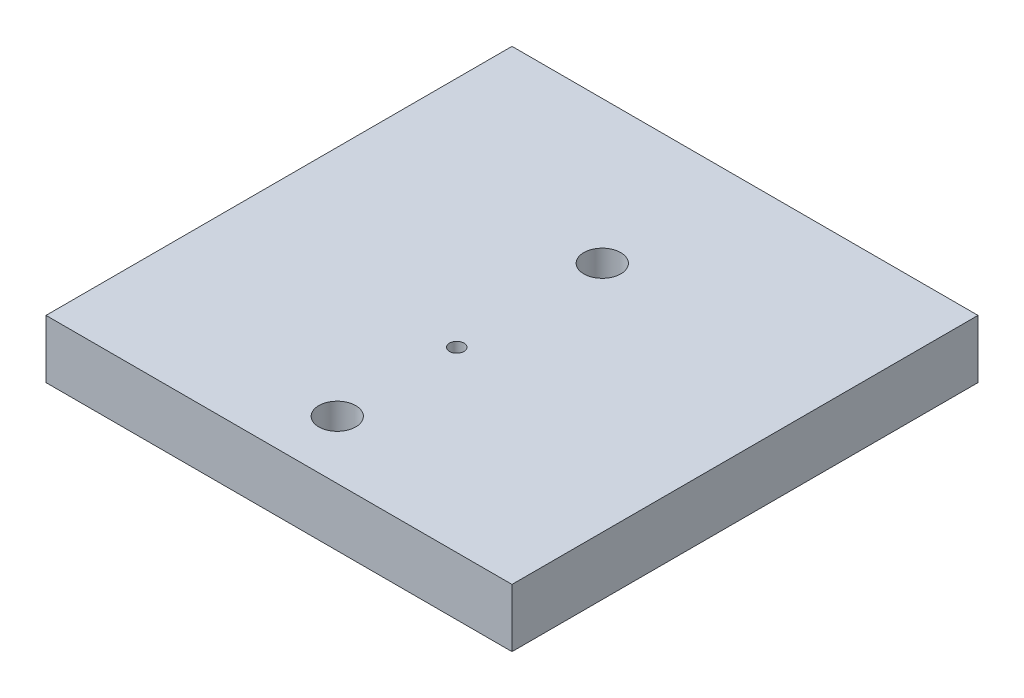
from build123d import *

# Parameters (mm, degrees)
SKETCH1_W           = 80
SKETCH1_H           = 80
BOSS_EXTRUDE1_DEPTH = 10
SKETCH2_R           = 3.175
SKETCH2_R_2         = 1.25
CUT_EXTRUDE1_DEPTH  = 10


with BuildPart() as part:
    # Sketch1 → Boss-Extrude1 (new body)
    with BuildSketch(Plane(origin=(0, 0, 0), x_dir=(1, 0, 0), z_dir=(0, 1, 0))):
        Rectangle(SKETCH1_W, SKETCH1_H)
    extrude(amount=BOSS_EXTRUDE1_DEPTH)

    # Sketch2 → Cut-Extrude1 (cut)
    with BuildSketch(Plane(origin=(0, 10, 0), x_dir=(1, 0, 0), z_dir=(0, 1, 0))):
        with Locations(Location((0, -30, 0), (0, 0, 270))):
            Circle(SKETCH2_R)
        with Locations(Location((0, -9.49, 0), (0, 0, 270))):
            Circle(SKETCH2_R_2)
        with Locations(Location((0, 15.5, 0), (0, 0, 270))):
            Circle(SKETCH2_R)
    extrude(amount=-CUT_EXTRUDE1_DEPTH, mode=Mode.SUBTRACT)


solid = part.part
